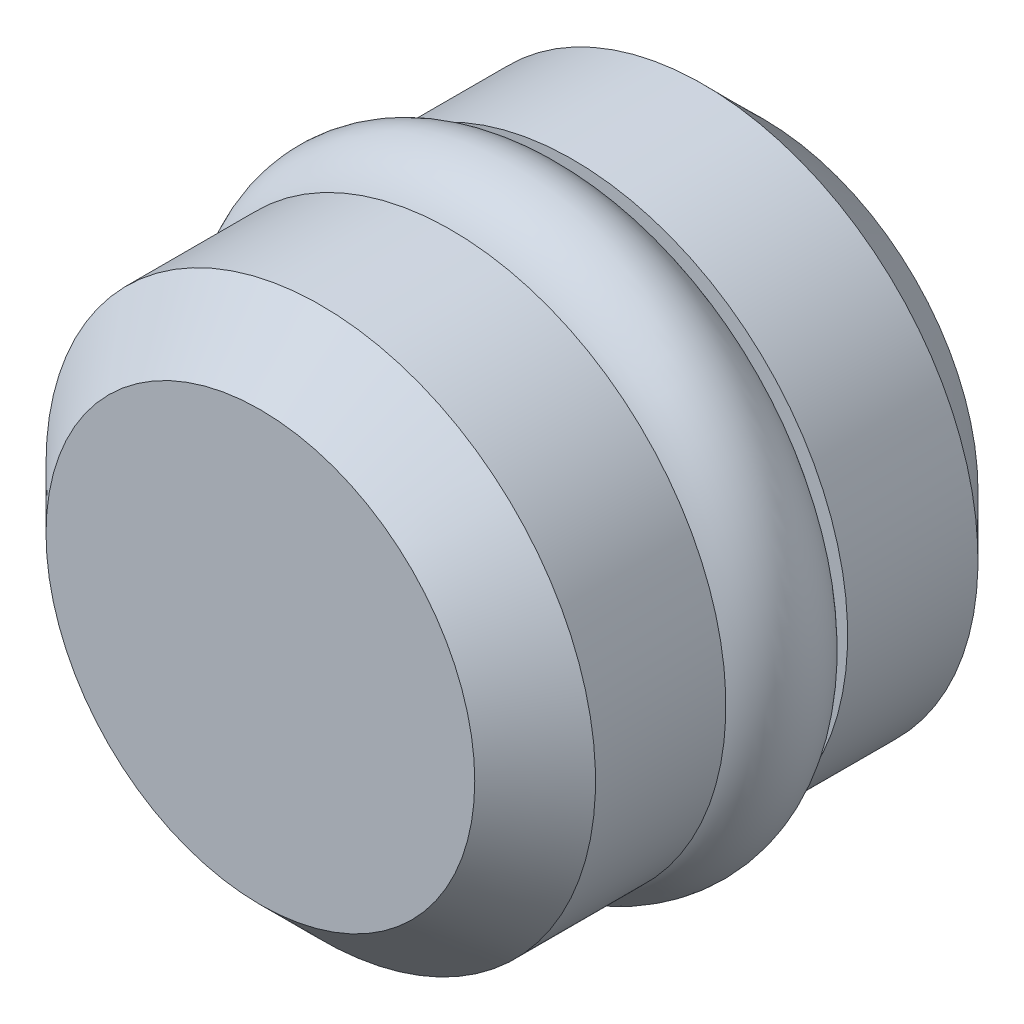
ISO-10303-21;
HEADER;
FILE_DESCRIPTION(('STEP AP214'),'2;1');
FILE_NAME('part.step','',(''),(''),'','','');
FILE_SCHEMA(('AUTOMOTIVE_DESIGN { 1 0 10303 214 1 1 1 1 }'));
ENDSEC;
DATA;
#1=APPLICATION_CONTEXT('core data for automotive mechanical design processes');
#2=APPLICATION_PROTOCOL_DEFINITION('international standard','automotive_design',2000,#1);
#3=PRODUCT_CONTEXT('',#1,'mechanical');
#4=PRODUCT('Part','Part','',(#3));
#5=PRODUCT_RELATED_PRODUCT_CATEGORY('part','',(#4));
#6=PRODUCT_DEFINITION_FORMATION('','',#4);
#7=PRODUCT_DEFINITION_CONTEXT('part definition',#1,'design');
#8=PRODUCT_DEFINITION('design','',#6,#7);
#9=PRODUCT_DEFINITION_SHAPE('','',#8);
#10=(LENGTH_UNIT() NAMED_UNIT(*) SI_UNIT(.MILLI.,.METRE.));
#11=(NAMED_UNIT(*) PLANE_ANGLE_UNIT() SI_UNIT($,.RADIAN.));
#12=(NAMED_UNIT(*) SI_UNIT($,.STERADIAN.) SOLID_ANGLE_UNIT());
#13=UNCERTAINTY_MEASURE_WITH_UNIT(LENGTH_MEASURE(1.E-05),#10,'distance_accuracy_value','');
#14=(GEOMETRIC_REPRESENTATION_CONTEXT(3) GLOBAL_UNCERTAINTY_ASSIGNED_CONTEXT((#13)) GLOBAL_UNIT_ASSIGNED_CONTEXT((#10,
#11,#12)) REPRESENTATION_CONTEXT('',''));
#15=CARTESIAN_POINT('',(0.,0.,0.));
#16=DIRECTION('',(0.,0.,1.));
#17=DIRECTION('',(1.,0.,0.));
#18=AXIS2_PLACEMENT_3D('',#15,#16,#17);
#19=CARTESIAN_POINT('',(0.,0.,3.175));
#20=DIRECTION('',(0.,0.,-1.));
#21=DIRECTION('',(-1.,0.,0.));
#22=AXIS2_PLACEMENT_3D('',#19,#20,#21);
#23=TOROIDAL_SURFACE('',#22,3.01625,0.76835);
#24=CARTESIAN_POINT('',(-3.7846,0.,3.175));
#25=VERTEX_POINT('',#24);
#26=VERTEX_LOOP('',#25);
#27=FACE_BOUND('',#26,.T.);
#28=ADVANCED_FACE('P0_F12',(#27),#23,.T.);
#29=CLOSED_SHELL('',(#28));
#30=MANIFOLD_SOLID_BREP('P0_B1',#29);
#31=CARTESIAN_POINT('',(0.,0.,6.35));
#32=DIRECTION('',(0.,0.,-1.));
#33=DIRECTION('',(-1.,0.,0.));
#34=AXIS2_PLACEMENT_3D('',#31,#32,#33);
#35=PLANE('',#34);
#36=CARTESIAN_POINT('',(0.,0.,6.34999999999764));
#37=DIRECTION('',(0.,0.,-1.));
#38=DIRECTION('',(-1.,0.,0.));
#39=AXIS2_PLACEMENT_3D('',#36,#37,#38);
#40=CIRCLE('',#39,2.70510000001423);
#41=CARTESIAN_POINT('',(-2.70510000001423,0.,6.34999999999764));
#42=VERTEX_POINT('',#41);
#43=EDGE_CURVE('P1_E19',#42,#42,#40,.T.);
#44=ORIENTED_EDGE('',*,*,#43,.F.);
#45=EDGE_LOOP('',(#44));
#46=FACE_BOUND('',#45,.T.);
#47=ADVANCED_FACE('P1_F15',(#46),#35,.F.);
#48=CARTESIAN_POINT('',(0.,0.,5.58800000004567));
#49=DIRECTION('',(0.,0.,-1.));
#50=DIRECTION('',(-1.,0.,0.));
#51=AXIS2_PLACEMENT_3D('',#48,#49,#50);
#52=CONICAL_SURFACE('',#51,3.46709999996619,0.785398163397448);
#53=CARTESIAN_POINT('',(0.,0.,5.588));
#54=DIRECTION('',(0.,0.,-1.));
#55=DIRECTION('',(-1.,0.,0.));
#56=AXIS2_PLACEMENT_3D('',#53,#54,#55);
#57=CIRCLE('',#56,3.4671);
#58=CARTESIAN_POINT('',(-3.4671,0.,5.588));
#59=VERTEX_POINT('',#58);
#60=EDGE_CURVE('P1_E39',#59,#59,#57,.T.);
#61=ORIENTED_EDGE('',*,*,#60,.F.);
#62=EDGE_LOOP('',(#61));
#63=FACE_BOUND('',#62,.T.);
#64=ORIENTED_EDGE('',*,*,#43,.T.);
#65=EDGE_LOOP('',(#64));
#66=FACE_BOUND('',#65,.T.);
#67=ADVANCED_FACE('P1_F61',(#63,#66),#52,.T.);
#68=CARTESIAN_POINT('',(0.,0.,6.35));
#69=DIRECTION('',(0.,0.,-1.));
#70=DIRECTION('',(-1.,0.,0.));
#71=AXIS2_PLACEMENT_3D('',#68,#69,#70);
#72=CYLINDRICAL_SURFACE('',#71,3.4671);
#73=CARTESIAN_POINT('',(0.,0.,3.94335));
#74=DIRECTION('',(0.,0.,-1.));
#75=DIRECTION('',(-1.,0.,0.));
#76=AXIS2_PLACEMENT_3D('',#73,#74,#75);
#77=CIRCLE('',#76,3.4671);
#78=CARTESIAN_POINT('',(-3.4671,0.,3.94335));
#79=VERTEX_POINT('',#78);
#80=EDGE_CURVE('P1_E48',#79,#79,#77,.T.);
#81=ORIENTED_EDGE('',*,*,#80,.F.);
#82=EDGE_LOOP('',(#81));
#83=FACE_BOUND('',#82,.T.);
#84=ORIENTED_EDGE('',*,*,#60,.T.);
#85=EDGE_LOOP('',(#84));
#86=FACE_BOUND('',#85,.T.);
#87=ADVANCED_FACE('P1_F59',(#83,#86),#72,.T.);
#88=CARTESIAN_POINT('',(-3.4671,0.,3.94335));
#89=DIRECTION('',(0.,0.,-1.));
#90=DIRECTION('',(-1.,0.,0.));
#91=AXIS2_PLACEMENT_3D('',#88,#89,#90);
#92=PLANE('',#91);
#93=CARTESIAN_POINT('',(0.,0.,3.94335));
#94=DIRECTION('',(0.,0.,-1.));
#95=DIRECTION('',(-1.,0.,0.));
#96=AXIS2_PLACEMENT_3D('',#93,#94,#95);
#97=CIRCLE('',#96,2.2479);
#98=CARTESIAN_POINT('',(-2.2479,0.,3.94335));
#99=VERTEX_POINT('',#98);
#100=EDGE_CURVE('P1_E44',#99,#99,#97,.T.);
#101=ORIENTED_EDGE('',*,*,#100,.F.);
#102=EDGE_LOOP('',(#101));
#103=FACE_BOUND('',#102,.T.);
#104=ORIENTED_EDGE('',*,*,#80,.T.);
#105=EDGE_LOOP('',(#104));
#106=FACE_BOUND('',#105,.T.);
#107=ADVANCED_FACE('P1_F79',(#103,#106),#92,.T.);
#108=CARTESIAN_POINT('',(0.,0.,0.));
#109=DIRECTION('',(0.,0.,-1.));
#110=DIRECTION('',(-1.,0.,0.));
#111=AXIS2_PLACEMENT_3D('',#108,#109,#110);
#112=CYLINDRICAL_SURFACE('',#111,2.2479);
#113=ORIENTED_EDGE('',*,*,#100,.T.);
#114=EDGE_LOOP('',(#113));
#115=FACE_BOUND('',#114,.T.);
#116=CARTESIAN_POINT('',(0.,0.,2.40665));
#117=DIRECTION('',(0.,0.,-1.));
#118=DIRECTION('',(-1.,0.,0.));
#119=AXIS2_PLACEMENT_3D('',#116,#117,#118);
#120=CIRCLE('',#119,2.2479);
#121=CARTESIAN_POINT('',(-2.2479,0.,2.40665));
#122=VERTEX_POINT('',#121);
#123=EDGE_CURVE('P1_E10',#122,#122,#120,.T.);
#124=ORIENTED_EDGE('',*,*,#123,.F.);
#125=EDGE_LOOP('',(#124));
#126=FACE_BOUND('',#125,.T.);
#127=ADVANCED_FACE('P1_F73',(#115,#126),#112,.T.);
#128=CARTESIAN_POINT('',(-2.2606,0.,2.40665));
#129=DIRECTION('',(0.,0.,1.));
#130=DIRECTION('',(1.,0.,0.));
#131=AXIS2_PLACEMENT_3D('',#128,#129,#130);
#132=PLANE('',#131);
#133=ORIENTED_EDGE('',*,*,#123,.T.);
#134=EDGE_LOOP('',(#133));
#135=FACE_BOUND('',#134,.T.);
#136=CARTESIAN_POINT('',(0.,0.,2.40665));
#137=DIRECTION('',(0.,0.,-1.));
#138=DIRECTION('',(-1.,0.,0.));
#139=AXIS2_PLACEMENT_3D('',#136,#137,#138);
#140=CIRCLE('',#139,3.4671);
#141=CARTESIAN_POINT('',(-3.4671,0.,2.40665));
#142=VERTEX_POINT('',#141);
#143=EDGE_CURVE('P1_E23',#142,#142,#140,.F.);
#144=ORIENTED_EDGE('',*,*,#143,.T.);
#145=EDGE_LOOP('',(#144));
#146=FACE_BOUND('',#145,.T.);
#147=ADVANCED_FACE('P1_F30',(#135,#146),#132,.T.);
#148=CARTESIAN_POINT('',(0.,0.,5.07999999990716));
#149=DIRECTION('',(0.,0.,-1.));
#150=DIRECTION('',(-1.,0.,0.));
#151=AXIS2_PLACEMENT_3D('',#148,#149,#150);
#152=CONICAL_SURFACE('',#151,1.32334000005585,1.02974425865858);
#153=CARTESIAN_POINT('',(0.,-8.5265128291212E-11,5.87514289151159));
#154=VERTEX_POINT('',#153);
#155=VERTEX_LOOP('',#154);
#156=FACE_BOUND('',#155,.T.);
#157=CARTESIAN_POINT('',(0.,0.,5.08));
#158=DIRECTION('',(0.,0.,1.));
#159=DIRECTION('',(1.,0.,0.));
#160=AXIS2_PLACEMENT_3D('',#157,#158,#159);
#161=CIRCLE('',#160,1.32334);
#162=CARTESIAN_POINT('',(1.32334,0.,5.08));
#163=VERTEX_POINT('',#162);
#164=EDGE_CURVE('P1_E33',#163,#163,#161,.F.);
#165=ORIENTED_EDGE('',*,*,#164,.T.);
#166=EDGE_LOOP('',(#165));
#167=FACE_BOUND('',#166,.T.);
#168=ADVANCED_FACE('P1_F17',(#156,#167),#152,.F.);
#169=CARTESIAN_POINT('',(0.,0.,0.));
#170=DIRECTION('',(0.,0.,1.));
#171=DIRECTION('',(1.,0.,0.));
#172=AXIS2_PLACEMENT_3D('',#169,#170,#171);
#173=CYLINDRICAL_SURFACE('',#172,1.32334);
#174=ORIENTED_EDGE('',*,*,#164,.F.);
#175=EDGE_LOOP('',(#174));
#176=FACE_BOUND('',#175,.T.);
#177=CARTESIAN_POINT('',(0.,0.,0.));
#178=DIRECTION('',(0.,0.,1.));
#179=DIRECTION('',(1.,0.,0.));
#180=AXIS2_PLACEMENT_3D('',#177,#178,#179);
#181=CIRCLE('',#180,1.32334);
#182=CARTESIAN_POINT('',(1.32334,0.,0.));
#183=VERTEX_POINT('',#182);
#184=EDGE_CURVE('P1_E37',#183,#183,#181,.T.);
#185=ORIENTED_EDGE('',*,*,#184,.F.);
#186=EDGE_LOOP('',(#185));
#187=FACE_BOUND('',#186,.T.);
#188=ADVANCED_FACE('P1_F29',(#176,#187),#173,.F.);
#189=CARTESIAN_POINT('',(0.,0.,0.));
#190=DIRECTION('',(0.,0.,-1.));
#191=DIRECTION('',(-1.,0.,0.));
#192=AXIS2_PLACEMENT_3D('',#189,#190,#191);
#193=PLANE('',#192);
#194=CARTESIAN_POINT('',(0.,0.,5.6843418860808E-11));
#195=DIRECTION('',(0.,0.,1.));
#196=DIRECTION('',(0.,-1.,0.));
#197=AXIS2_PLACEMENT_3D('',#194,#195,#196);
#198=CIRCLE('',#197,2.70510000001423);
#199=CARTESIAN_POINT('',(0.,-2.70510000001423,5.6843461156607E-11));
#200=VERTEX_POINT('',#199);
#201=EDGE_CURVE('P1_E51',#200,#200,#198,.T.);
#202=ORIENTED_EDGE('',*,*,#201,.F.);
#203=EDGE_LOOP('',(#202));
#204=FACE_BOUND('',#203,.T.);
#205=ORIENTED_EDGE('',*,*,#184,.T.);
#206=EDGE_LOOP('',(#205));
#207=FACE_BOUND('',#206,.T.);
#208=ADVANCED_FACE('P1_F94',(#204,#207),#193,.T.);
#209=CARTESIAN_POINT('',(0.,0.,0.762000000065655));
#210=DIRECTION('',(0.,0.,1.));
#211=DIRECTION('',(0.,-1.,0.));
#212=AXIS2_PLACEMENT_3D('',#209,#210,#211);
#213=CONICAL_SURFACE('',#212,3.46710000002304,0.785398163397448);
#214=CARTESIAN_POINT('',(0.,0.,0.762));
#215=DIRECTION('',(0.,0.,-1.));
#216=DIRECTION('',(-1.,0.,0.));
#217=AXIS2_PLACEMENT_3D('',#214,#215,#216);
#218=CIRCLE('',#217,3.4671);
#219=CARTESIAN_POINT('',(-3.4671,0.,0.762));
#220=VERTEX_POINT('',#219);
#221=EDGE_CURVE('P1_E47',#220,#220,#218,.F.);
#222=ORIENTED_EDGE('',*,*,#221,.F.);
#223=EDGE_LOOP('',(#222));
#224=FACE_BOUND('',#223,.T.);
#225=ORIENTED_EDGE('',*,*,#201,.T.);
#226=EDGE_LOOP('',(#225));
#227=FACE_BOUND('',#226,.T.);
#228=ADVANCED_FACE('P1_F87',(#224,#227),#213,.T.);
#229=CARTESIAN_POINT('',(0.,0.,6.35));
#230=DIRECTION('',(0.,0.,-1.));
#231=DIRECTION('',(-1.,0.,0.));
#232=AXIS2_PLACEMENT_3D('',#229,#230,#231);
#233=CYLINDRICAL_SURFACE('',#232,3.4671);
#234=ORIENTED_EDGE('',*,*,#221,.T.);
#235=EDGE_LOOP('',(#234));
#236=FACE_BOUND('',#235,.T.);
#237=ORIENTED_EDGE('',*,*,#143,.F.);
#238=EDGE_LOOP('',(#237));
#239=FACE_BOUND('',#238,.T.);
#240=ADVANCED_FACE('P1_F84',(#236,#239),#233,.T.);
#241=CLOSED_SHELL('',(#47,#67,#87,#107,#127,#147,#168,#188,#208,#228,#240));
#242=MANIFOLD_SOLID_BREP('P1_B1',#241);
#243=ADVANCED_BREP_SHAPE_REPRESENTATION('',(#18,#30,#242),#14);
#244=SHAPE_DEFINITION_REPRESENTATION(#9,#243);
ENDSEC;
END-ISO-10303-21;
